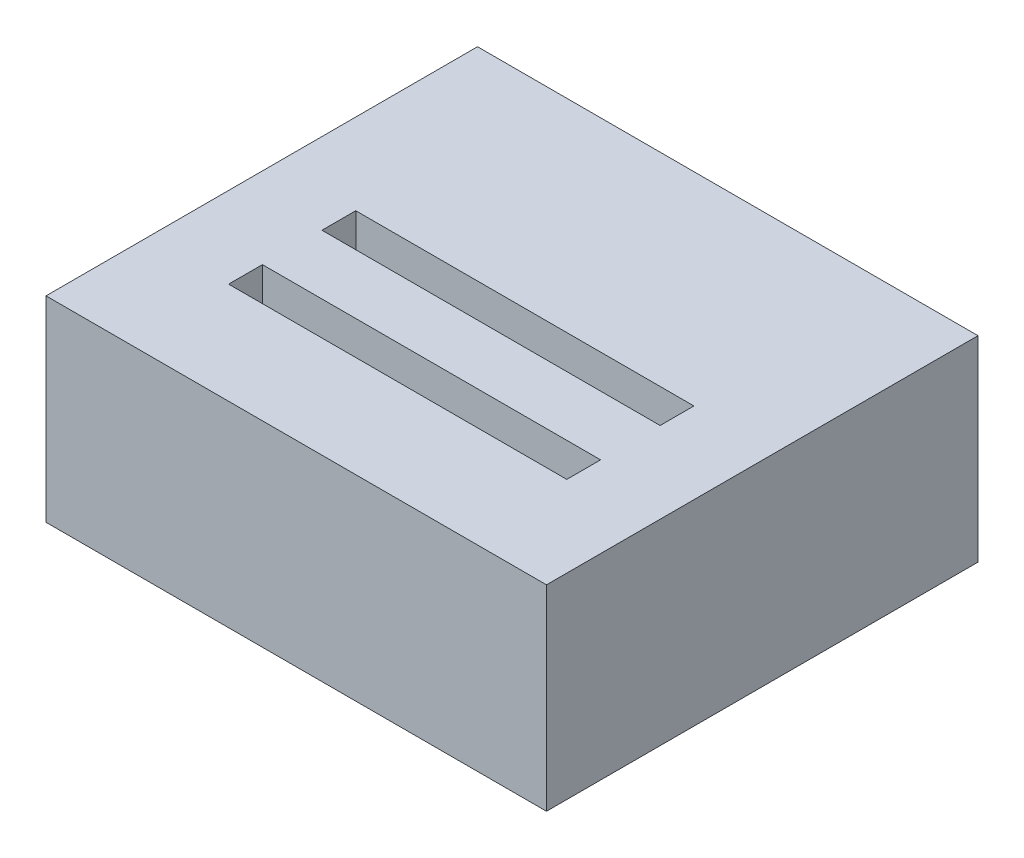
ISO-10303-21;
HEADER;
FILE_DESCRIPTION(('STEP AP214'),'2;1');
FILE_NAME('part.step','',(''),(''),'','','');
FILE_SCHEMA(('AUTOMOTIVE_DESIGN { 1 0 10303 214 1 1 1 1 }'));
ENDSEC;
DATA;
#1=APPLICATION_CONTEXT('core data for automotive mechanical design processes');
#2=APPLICATION_PROTOCOL_DEFINITION('international standard','automotive_design',2000,#1);
#3=PRODUCT_CONTEXT('',#1,'mechanical');
#4=PRODUCT('Part','Part','',(#3));
#5=PRODUCT_RELATED_PRODUCT_CATEGORY('part','',(#4));
#6=PRODUCT_DEFINITION_FORMATION('','',#4);
#7=PRODUCT_DEFINITION_CONTEXT('part definition',#1,'design');
#8=PRODUCT_DEFINITION('design','',#6,#7);
#9=PRODUCT_DEFINITION_SHAPE('','',#8);
#10=(LENGTH_UNIT() NAMED_UNIT(*) SI_UNIT(.MILLI.,.METRE.));
#11=(NAMED_UNIT(*) PLANE_ANGLE_UNIT() SI_UNIT($,.RADIAN.));
#12=(NAMED_UNIT(*) SI_UNIT($,.STERADIAN.) SOLID_ANGLE_UNIT());
#13=UNCERTAINTY_MEASURE_WITH_UNIT(LENGTH_MEASURE(1.E-05),#10,'distance_accuracy_value','');
#14=(GEOMETRIC_REPRESENTATION_CONTEXT(3) GLOBAL_UNCERTAINTY_ASSIGNED_CONTEXT((#13)) GLOBAL_UNIT_ASSIGNED_CONTEXT((#10,
#11,#12)) REPRESENTATION_CONTEXT('',''));
#15=CARTESIAN_POINT('',(0.,0.,0.));
#16=DIRECTION('',(0.,0.,1.));
#17=DIRECTION('',(1.,0.,0.));
#18=AXIS2_PLACEMENT_3D('',#15,#16,#17);
#19=CARTESIAN_POINT('',(-4.318,-2.413,7.62));
#20=DIRECTION('',(0.,1.,0.));
#21=DIRECTION('',(0.,0.,1.));
#22=AXIS2_PLACEMENT_3D('',#19,#20,#21);
#23=PLANE('',#22);
#24=DIRECTION('',(0.,0.,-1.));
#25=VECTOR('',#24,1.);
#26=CARTESIAN_POINT('',(-1.27,-2.413,12.3952));
#27=LINE('',#26,#25);
#28=CARTESIAN_POINT('',(-1.27,-2.413,12.3952));
#29=VERTEX_POINT('',#28);
#30=CARTESIAN_POINT('',(-1.27,-2.413,11.1252));
#31=VERTEX_POINT('',#30);
#32=EDGE_CURVE('E301',#29,#31,#27,.T.);
#33=ORIENTED_EDGE('',*,*,#32,.F.);
#34=DIRECTION('',(1.,0.,0.));
#35=VECTOR('',#34,1.);
#36=CARTESIAN_POINT('',(-4.318,-2.413,12.3952));
#37=LINE('',#36,#35);
#38=CARTESIAN_POINT('',(11.43,-2.413,12.3952));
#39=VERTEX_POINT('',#38);
#40=EDGE_CURVE('E169',#29,#39,#37,.T.);
#41=ORIENTED_EDGE('',*,*,#40,.T.);
#42=DIRECTION('',(0.,0.,-1.));
#43=VECTOR('',#42,1.);
#44=CARTESIAN_POINT('',(11.43,-2.413,12.3952));
#45=LINE('',#44,#43);
#46=CARTESIAN_POINT('',(11.43,-2.413,11.1252));
#47=VERTEX_POINT('',#46);
#48=EDGE_CURVE('E277',#39,#47,#45,.T.);
#49=ORIENTED_EDGE('',*,*,#48,.T.);
#50=DIRECTION('',(1.,0.,0.));
#51=VECTOR('',#50,1.);
#52=CARTESIAN_POINT('',(-4.318,-2.413,11.1252));
#53=LINE('',#52,#51);
#54=EDGE_CURVE('E299',#31,#47,#53,.T.);
#55=ORIENTED_EDGE('',*,*,#54,.F.);
#56=EDGE_LOOP('',(#33,#41,#49,#55));
#57=FACE_BOUND('',#56,.T.);
#58=DIRECTION('',(0.,0.,-1.));
#59=VECTOR('',#58,1.);
#60=CARTESIAN_POINT('',(2.667,-2.413,0.));
#61=LINE('',#60,#59);
#62=CARTESIAN_POINT('',(2.667,-2.413,7.62));
#63=VERTEX_POINT('',#62);
#64=CARTESIAN_POINT('',(2.667,-2.413,0.));
#65=VERTEX_POINT('',#64);
#66=EDGE_CURVE('E168',#63,#65,#61,.T.);
#67=ORIENTED_EDGE('',*,*,#66,.F.);
#68=DIRECTION('',(1.,0.,0.));
#69=VECTOR('',#68,1.);
#70=CARTESIAN_POINT('',(-4.318,-2.413,7.62));
#71=LINE('',#70,#69);
#72=CARTESIAN_POINT('',(-1.27,-2.413,7.62));
#73=VERTEX_POINT('',#72);
#74=EDGE_CURVE('E207',#73,#63,#71,.T.);
#75=ORIENTED_EDGE('',*,*,#74,.F.);
#76=DIRECTION('',(0.,0.,-1.));
#77=VECTOR('',#76,1.);
#78=CARTESIAN_POINT('',(-1.27,-2.413,8.89));
#79=LINE('',#78,#77);
#80=CARTESIAN_POINT('',(-1.27,-2.413,8.89));
#81=VERTEX_POINT('',#80);
#82=EDGE_CURVE('E338',#81,#73,#79,.T.);
#83=ORIENTED_EDGE('',*,*,#82,.F.);
#84=DIRECTION('',(1.,0.,0.));
#85=VECTOR('',#84,1.);
#86=CARTESIAN_POINT('',(-4.318,-2.413,8.89));
#87=LINE('',#86,#85);
#88=CARTESIAN_POINT('',(11.43,-2.413,8.89));
#89=VERTEX_POINT('',#88);
#90=EDGE_CURVE('E305',#81,#89,#87,.T.);
#91=ORIENTED_EDGE('',*,*,#90,.T.);
#92=DIRECTION('',(0.,0.,-1.));
#93=VECTOR('',#92,1.);
#94=CARTESIAN_POINT('',(11.43,-2.413,8.89));
#95=LINE('',#94,#93);
#96=CARTESIAN_POINT('',(11.43,-2.413,7.62));
#97=VERTEX_POINT('',#96);
#98=EDGE_CURVE('E321',#89,#97,#95,.T.);
#99=ORIENTED_EDGE('',*,*,#98,.T.);
#100=CARTESIAN_POINT('',(7.493,-2.413,7.62));
#101=VERTEX_POINT('',#100);
#102=EDGE_CURVE('E212',#101,#97,#71,.T.);
#103=ORIENTED_EDGE('',*,*,#102,.F.);
#104=DIRECTION('',(0.,0.,1.));
#105=VECTOR('',#104,1.);
#106=CARTESIAN_POINT('',(7.493,-2.413,0.));
#107=LINE('',#106,#105);
#108=CARTESIAN_POINT('',(7.493,-2.413,0.));
#109=VERTEX_POINT('',#108);
#110=EDGE_CURVE('E50',#109,#101,#107,.T.);
#111=ORIENTED_EDGE('',*,*,#110,.F.);
#112=DIRECTION('',(1.,0.,0.));
#113=VECTOR('',#112,1.);
#114=CARTESIAN_POINT('',(-4.318,-2.413,0.));
#115=LINE('',#114,#113);
#116=CARTESIAN_POINT('',(14.478,-2.413,0.));
#117=VERTEX_POINT('',#116);
#118=EDGE_CURVE('E194',#109,#117,#115,.T.);
#119=ORIENTED_EDGE('',*,*,#118,.T.);
#120=DIRECTION('',(0.,0.,-1.));
#121=VECTOR('',#120,1.);
#122=CARTESIAN_POINT('',(14.478,-2.413,7.62));
#123=LINE('',#122,#121);
#124=CARTESIAN_POINT('',(14.478,-2.413,16.2052));
#125=VERTEX_POINT('',#124);
#126=EDGE_CURVE('E42',#125,#117,#123,.T.);
#127=ORIENTED_EDGE('',*,*,#126,.F.);
#128=DIRECTION('',(1.,0.,0.));
#129=VECTOR('',#128,1.);
#130=CARTESIAN_POINT('',(-4.318,-2.413,16.2052));
#131=LINE('',#130,#129);
#132=CARTESIAN_POINT('',(-4.318,-2.413,16.2052));
#133=VERTEX_POINT('',#132);
#134=EDGE_CURVE('E266',#133,#125,#131,.T.);
#135=ORIENTED_EDGE('',*,*,#134,.F.);
#136=DIRECTION('',(0.,0.,-1.));
#137=VECTOR('',#136,1.);
#138=CARTESIAN_POINT('',(-4.318,-2.413,7.62));
#139=LINE('',#138,#137);
#140=CARTESIAN_POINT('',(-4.318,-2.413,0.));
#141=VERTEX_POINT('',#140);
#142=EDGE_CURVE('E11',#133,#141,#139,.T.);
#143=ORIENTED_EDGE('',*,*,#142,.T.);
#144=EDGE_CURVE('E56',#141,#65,#115,.T.);
#145=ORIENTED_EDGE('',*,*,#144,.T.);
#146=EDGE_LOOP('',(#67,#75,#83,#91,#99,#103,#111,#119,#127,#135,#143,#145));
#147=FACE_BOUND('',#146,.T.);
#148=ADVANCED_FACE('F33',(#57,#147),#23,.F.);
#149=CARTESIAN_POINT('',(-4.318,-2.413,11.1252));
#150=DIRECTION('',(0.,0.,1.));
#151=DIRECTION('',(1.,0.,0.));
#152=AXIS2_PLACEMENT_3D('',#149,#150,#151);
#153=PLANE('',#152);
#154=ORIENTED_EDGE('',*,*,#54,.T.);
#155=DIRECTION('',(0.,-1.,0.));
#156=VECTOR('',#155,1.);
#157=CARTESIAN_POINT('',(11.43,4.953,11.1252));
#158=LINE('',#157,#156);
#159=CARTESIAN_POINT('',(11.43,4.953,11.1252));
#160=VERTEX_POINT('',#159);
#161=EDGE_CURVE('E278',#160,#47,#158,.T.);
#162=ORIENTED_EDGE('',*,*,#161,.F.);
#163=DIRECTION('',(-1.,0.,0.));
#164=VECTOR('',#163,1.);
#165=CARTESIAN_POINT('',(-4.318,4.953,11.1252));
#166=LINE('',#165,#164);
#167=CARTESIAN_POINT('',(-1.27,4.953,11.1252));
#168=VERTEX_POINT('',#167);
#169=EDGE_CURVE('E232',#160,#168,#166,.T.);
#170=ORIENTED_EDGE('',*,*,#169,.T.);
#171=DIRECTION('',(0.,1.,0.));
#172=VECTOR('',#171,1.);
#173=CARTESIAN_POINT('',(-1.27,4.953,11.1252));
#174=LINE('',#173,#172);
#175=EDGE_CURVE('E287',#31,#168,#174,.T.);
#176=ORIENTED_EDGE('',*,*,#175,.F.);
#177=EDGE_LOOP('',(#154,#162,#170,#176));
#178=FACE_BOUND('',#177,.T.);
#179=ADVANCED_FACE('F396',(#178),#153,.T.);
#180=CARTESIAN_POINT('',(-4.318,-2.413,7.62));
#181=DIRECTION('',(0.,0.,1.));
#182=DIRECTION('',(1.,0.,0.));
#183=AXIS2_PLACEMENT_3D('',#180,#181,#182);
#184=PLANE('',#183);
#185=CARTESIAN_POINT('',(0.,0.,7.62));
#186=DIRECTION('',(0.,0.,1.));
#187=DIRECTION('',(1.,0.,0.));
#188=AXIS2_PLACEMENT_3D('',#185,#186,#187);
#189=CIRCLE('',#188,0.508);
#190=CARTESIAN_POINT('',(0.508,0.,7.62));
#191=VERTEX_POINT('',#190);
#192=EDGE_CURVE('E226',#191,#191,#189,.F.);
#193=ORIENTED_EDGE('',*,*,#192,.T.);
#194=EDGE_LOOP('',(#193));
#195=FACE_BOUND('',#194,.T.);
#196=CARTESIAN_POINT('',(2.54,0.,7.62));
#197=DIRECTION('',(0.,0.,1.));
#198=DIRECTION('',(1.,0.,0.));
#199=AXIS2_PLACEMENT_3D('',#196,#197,#198);
#200=CIRCLE('',#199,0.508);
#201=CARTESIAN_POINT('',(3.048,0.,7.62));
#202=VERTEX_POINT('',#201);
#203=EDGE_CURVE('E386',#202,#202,#200,.F.);
#204=ORIENTED_EDGE('',*,*,#203,.T.);
#205=EDGE_LOOP('',(#204));
#206=FACE_BOUND('',#205,.T.);
#207=CARTESIAN_POINT('',(5.08,0.,7.62));
#208=DIRECTION('',(0.,0.,1.));
#209=DIRECTION('',(1.,0.,0.));
#210=AXIS2_PLACEMENT_3D('',#207,#208,#209);
#211=CIRCLE('',#210,0.508);
#212=CARTESIAN_POINT('',(5.588,0.,7.62));
#213=VERTEX_POINT('',#212);
#214=EDGE_CURVE('E380',#213,#213,#211,.F.);
#215=ORIENTED_EDGE('',*,*,#214,.T.);
#216=EDGE_LOOP('',(#215));
#217=FACE_BOUND('',#216,.T.);
#218=CARTESIAN_POINT('',(7.62,0.,7.62));
#219=DIRECTION('',(0.,0.,1.));
#220=DIRECTION('',(1.,0.,0.));
#221=AXIS2_PLACEMENT_3D('',#218,#219,#220);
#222=CIRCLE('',#221,0.508);
#223=CARTESIAN_POINT('',(8.128,0.,7.62));
#224=VERTEX_POINT('',#223);
#225=EDGE_CURVE('E374',#224,#224,#222,.F.);
#226=ORIENTED_EDGE('',*,*,#225,.T.);
#227=EDGE_LOOP('',(#226));
#228=FACE_BOUND('',#227,.T.);
#229=CARTESIAN_POINT('',(10.16,0.,7.62));
#230=DIRECTION('',(0.,0.,1.));
#231=DIRECTION('',(1.,0.,0.));
#232=AXIS2_PLACEMENT_3D('',#229,#230,#231);
#233=CIRCLE('',#232,0.508);
#234=CARTESIAN_POINT('',(10.668,0.,7.62));
#235=VERTEX_POINT('',#234);
#236=EDGE_CURVE('E368',#235,#235,#233,.F.);
#237=ORIENTED_EDGE('',*,*,#236,.T.);
#238=EDGE_LOOP('',(#237));
#239=FACE_BOUND('',#238,.T.);
#240=CARTESIAN_POINT('',(0.,2.54,7.62));
#241=DIRECTION('',(0.,0.,1.));
#242=DIRECTION('',(1.,0.,0.));
#243=AXIS2_PLACEMENT_3D('',#240,#241,#242);
#244=CIRCLE('',#243,0.508);
#245=CARTESIAN_POINT('',(0.508,2.54,7.62));
#246=VERTEX_POINT('',#245);
#247=EDGE_CURVE('E362',#246,#246,#244,.F.);
#248=ORIENTED_EDGE('',*,*,#247,.T.);
#249=EDGE_LOOP('',(#248));
#250=FACE_BOUND('',#249,.T.);
#251=CARTESIAN_POINT('',(2.54,2.54,7.62));
#252=DIRECTION('',(0.,0.,1.));
#253=DIRECTION('',(1.,0.,0.));
#254=AXIS2_PLACEMENT_3D('',#251,#252,#253);
#255=CIRCLE('',#254,0.508);
#256=CARTESIAN_POINT('',(3.048,2.54,7.62));
#257=VERTEX_POINT('',#256);
#258=EDGE_CURVE('E356',#257,#257,#255,.F.);
#259=ORIENTED_EDGE('',*,*,#258,.T.);
#260=EDGE_LOOP('',(#259));
#261=FACE_BOUND('',#260,.T.);
#262=CARTESIAN_POINT('',(5.08,2.54,7.62));
#263=DIRECTION('',(0.,0.,1.));
#264=DIRECTION('',(1.,0.,0.));
#265=AXIS2_PLACEMENT_3D('',#262,#263,#264);
#266=CIRCLE('',#265,0.508);
#267=CARTESIAN_POINT('',(5.588,2.54,7.62));
#268=VERTEX_POINT('',#267);
#269=EDGE_CURVE('E350',#268,#268,#266,.F.);
#270=ORIENTED_EDGE('',*,*,#269,.T.);
#271=EDGE_LOOP('',(#270));
#272=FACE_BOUND('',#271,.T.);
#273=CARTESIAN_POINT('',(7.62,2.54,7.62));
#274=DIRECTION('',(0.,0.,1.));
#275=DIRECTION('',(1.,0.,0.));
#276=AXIS2_PLACEMENT_3D('',#273,#274,#275);
#277=CIRCLE('',#276,0.508);
#278=CARTESIAN_POINT('',(8.128,2.54,7.62));
#279=VERTEX_POINT('',#278);
#280=EDGE_CURVE('E344',#279,#279,#277,.F.);
#281=ORIENTED_EDGE('',*,*,#280,.T.);
#282=EDGE_LOOP('',(#281));
#283=FACE_BOUND('',#282,.T.);
#284=CARTESIAN_POINT('',(10.16,2.54,7.62));
#285=DIRECTION('',(0.,0.,1.));
#286=DIRECTION('',(1.,0.,0.));
#287=AXIS2_PLACEMENT_3D('',#284,#285,#286);
#288=CIRCLE('',#287,0.508);
#289=CARTESIAN_POINT('',(10.668,2.54,7.62));
#290=VERTEX_POINT('',#289);
#291=EDGE_CURVE('E337',#290,#290,#288,.F.);
#292=ORIENTED_EDGE('',*,*,#291,.T.);
#293=EDGE_LOOP('',(#292));
#294=FACE_BOUND('',#293,.T.);
#295=ORIENTED_EDGE('',*,*,#74,.T.);
#296=DIRECTION('',(0.,1.,0.));
#297=VECTOR('',#296,1.);
#298=CARTESIAN_POINT('',(2.667,-3.048,7.62));
#299=LINE('',#298,#297);
#300=CARTESIAN_POINT('',(2.667,-3.048,7.62));
#301=VERTEX_POINT('',#300);
#302=EDGE_CURVE('E182',#301,#63,#299,.T.);
#303=ORIENTED_EDGE('',*,*,#302,.F.);
#304=DIRECTION('',(-1.,0.,0.));
#305=VECTOR('',#304,1.);
#306=CARTESIAN_POINT('',(2.667,-3.048,7.62));
#307=LINE('',#306,#305);
#308=CARTESIAN_POINT('',(7.493,-3.048,7.62));
#309=VERTEX_POINT('',#308);
#310=EDGE_CURVE('E162',#309,#301,#307,.T.);
#311=ORIENTED_EDGE('',*,*,#310,.F.);
#312=DIRECTION('',(0.,1.,0.));
#313=VECTOR('',#312,1.);
#314=CARTESIAN_POINT('',(7.493,-3.048,7.62));
#315=LINE('',#314,#313);
#316=EDGE_CURVE('E174',#309,#101,#315,.T.);
#317=ORIENTED_EDGE('',*,*,#316,.T.);
#318=ORIENTED_EDGE('',*,*,#102,.T.);
#319=DIRECTION('',(0.,-1.,0.));
#320=VECTOR('',#319,1.);
#321=CARTESIAN_POINT('',(11.43,4.953,7.62));
#322=LINE('',#321,#320);
#323=CARTESIAN_POINT('',(11.43,4.953,7.62));
#324=VERTEX_POINT('',#323);
#325=EDGE_CURVE('E322',#324,#97,#322,.T.);
#326=ORIENTED_EDGE('',*,*,#325,.F.);
#327=DIRECTION('',(-1.,0.,0.));
#328=VECTOR('',#327,1.);
#329=CARTESIAN_POINT('',(-4.318,4.953,7.62));
#330=LINE('',#329,#328);
#331=CARTESIAN_POINT('',(-1.27,4.953,7.62));
#332=VERTEX_POINT('',#331);
#333=EDGE_CURVE('E211',#324,#332,#330,.T.);
#334=ORIENTED_EDGE('',*,*,#333,.T.);
#335=DIRECTION('',(0.,1.,0.));
#336=VECTOR('',#335,1.);
#337=CARTESIAN_POINT('',(-1.27,4.953,7.62));
#338=LINE('',#337,#336);
#339=EDGE_CURVE('E209',#73,#332,#338,.T.);
#340=ORIENTED_EDGE('',*,*,#339,.F.);
#341=EDGE_LOOP('',(#295,#303,#311,#317,#318,#326,#334,#340));
#342=FACE_BOUND('',#341,.T.);
#343=ADVANCED_FACE('F205',(#195,#206,#217,#228,#239,#250,#261,#272,#283,#294,#342),#184,.T.);
#344=CARTESIAN_POINT('',(-4.318,4.953,7.62));
#345=DIRECTION('',(1.,0.,0.));
#346=DIRECTION('',(0.,1.,0.));
#347=AXIS2_PLACEMENT_3D('',#344,#345,#346);
#348=PLANE('',#347);
#349=DIRECTION('',(0.,-1.,0.));
#350=VECTOR('',#349,1.);
#351=CARTESIAN_POINT('',(-4.318,4.953,0.));
#352=LINE('',#351,#350);
#353=CARTESIAN_POINT('',(-4.318,4.953,0.));
#354=VERTEX_POINT('',#353);
#355=EDGE_CURVE('E238',#354,#141,#352,.T.);
#356=ORIENTED_EDGE('',*,*,#355,.T.);
#357=ORIENTED_EDGE('',*,*,#142,.F.);
#358=DIRECTION('',(0.,-1.,0.));
#359=VECTOR('',#358,1.);
#360=CARTESIAN_POINT('',(-4.318,4.953,16.2052));
#361=LINE('',#360,#359);
#362=CARTESIAN_POINT('',(-4.318,4.953,16.2052));
#363=VERTEX_POINT('',#362);
#364=EDGE_CURVE('E189',#363,#133,#361,.T.);
#365=ORIENTED_EDGE('',*,*,#364,.F.);
#366=DIRECTION('',(0.,0.,-1.));
#367=VECTOR('',#366,1.);
#368=CARTESIAN_POINT('',(-4.318,4.953,7.62));
#369=LINE('',#368,#367);
#370=EDGE_CURVE('E214',#363,#354,#369,.T.);
#371=ORIENTED_EDGE('',*,*,#370,.T.);
#372=EDGE_LOOP('',(#356,#357,#365,#371));
#373=FACE_BOUND('',#372,.T.);
#374=ADVANCED_FACE('F35',(#373),#348,.F.);
#375=CARTESIAN_POINT('',(14.478,4.953,7.62));
#376=DIRECTION('',(-1.,0.,0.));
#377=DIRECTION('',(0.,0.,1.));
#378=AXIS2_PLACEMENT_3D('',#375,#376,#377);
#379=PLANE('',#378);
#380=DIRECTION('',(0.,1.,0.));
#381=VECTOR('',#380,1.);
#382=CARTESIAN_POINT('',(14.478,4.953,0.));
#383=LINE('',#382,#381);
#384=CARTESIAN_POINT('',(14.478,4.953,0.));
#385=VERTEX_POINT('',#384);
#386=EDGE_CURVE('E235',#117,#385,#383,.T.);
#387=ORIENTED_EDGE('',*,*,#386,.T.);
#388=DIRECTION('',(0.,0.,-1.));
#389=VECTOR('',#388,1.);
#390=CARTESIAN_POINT('',(14.478,4.953,7.62));
#391=LINE('',#390,#389);
#392=CARTESIAN_POINT('',(14.478,4.953,16.2052));
#393=VERTEX_POINT('',#392);
#394=EDGE_CURVE('E244',#393,#385,#391,.T.);
#395=ORIENTED_EDGE('',*,*,#394,.F.);
#396=DIRECTION('',(0.,1.,0.));
#397=VECTOR('',#396,1.);
#398=CARTESIAN_POINT('',(14.478,4.953,16.2052));
#399=LINE('',#398,#397);
#400=EDGE_CURVE('E252',#125,#393,#399,.T.);
#401=ORIENTED_EDGE('',*,*,#400,.F.);
#402=ORIENTED_EDGE('',*,*,#126,.T.);
#403=EDGE_LOOP('',(#387,#395,#401,#402));
#404=FACE_BOUND('',#403,.T.);
#405=ADVANCED_FACE('F250',(#404),#379,.F.);
#406=CARTESIAN_POINT('',(-4.318,4.953,7.62));
#407=DIRECTION('',(0.,-1.,0.));
#408=DIRECTION('',(0.,0.,-1.));
#409=AXIS2_PLACEMENT_3D('',#406,#407,#408);
#410=PLANE('',#409);
#411=ORIENTED_EDGE('',*,*,#370,.F.);
#412=DIRECTION('',(-1.,0.,0.));
#413=VECTOR('',#412,1.);
#414=CARTESIAN_POINT('',(-4.318,4.953,16.2052));
#415=LINE('',#414,#413);
#416=EDGE_CURVE('E281',#393,#363,#415,.T.);
#417=ORIENTED_EDGE('',*,*,#416,.F.);
#418=ORIENTED_EDGE('',*,*,#394,.T.);
#419=DIRECTION('',(-1.,0.,0.));
#420=VECTOR('',#419,1.);
#421=CARTESIAN_POINT('',(-4.318,4.953,0.));
#422=LINE('',#421,#420);
#423=EDGE_CURVE('E216',#385,#354,#422,.T.);
#424=ORIENTED_EDGE('',*,*,#423,.T.);
#425=EDGE_LOOP('',(#411,#417,#418,#424));
#426=FACE_BOUND('',#425,.T.);
#427=DIRECTION('',(-1.,0.,0.));
#428=VECTOR('',#427,1.);
#429=CARTESIAN_POINT('',(-4.318,4.953,12.3952));
#430=LINE('',#429,#428);
#431=CARTESIAN_POINT('',(11.43,4.953,12.3952));
#432=VERTEX_POINT('',#431);
#433=CARTESIAN_POINT('',(-1.27,4.953,12.3952));
#434=VERTEX_POINT('',#433);
#435=EDGE_CURVE('E172',#432,#434,#430,.T.);
#436=ORIENTED_EDGE('',*,*,#435,.T.);
#437=DIRECTION('',(0.,0.,-1.));
#438=VECTOR('',#437,1.);
#439=CARTESIAN_POINT('',(-1.27,4.953,12.3952));
#440=LINE('',#439,#438);
#441=EDGE_CURVE('E291',#434,#168,#440,.T.);
#442=ORIENTED_EDGE('',*,*,#441,.T.);
#443=ORIENTED_EDGE('',*,*,#169,.F.);
#444=DIRECTION('',(0.,0.,-1.));
#445=VECTOR('',#444,1.);
#446=CARTESIAN_POINT('',(11.43,4.953,12.3952));
#447=LINE('',#446,#445);
#448=EDGE_CURVE('E284',#432,#160,#447,.T.);
#449=ORIENTED_EDGE('',*,*,#448,.F.);
#450=EDGE_LOOP('',(#436,#442,#443,#449));
#451=FACE_BOUND('',#450,.T.);
#452=DIRECTION('',(-1.,0.,0.));
#453=VECTOR('',#452,1.);
#454=CARTESIAN_POINT('',(-4.318,4.953,8.89));
#455=LINE('',#454,#453);
#456=CARTESIAN_POINT('',(11.43,4.953,8.89));
#457=VERTEX_POINT('',#456);
#458=CARTESIAN_POINT('',(-1.27,4.953,8.89));
#459=VERTEX_POINT('',#458);
#460=EDGE_CURVE('E310',#457,#459,#455,.T.);
#461=ORIENTED_EDGE('',*,*,#460,.T.);
#462=DIRECTION('',(0.,0.,-1.));
#463=VECTOR('',#462,1.);
#464=CARTESIAN_POINT('',(-1.27,4.953,8.89));
#465=LINE('',#464,#463);
#466=EDGE_CURVE('E331',#459,#332,#465,.T.);
#467=ORIENTED_EDGE('',*,*,#466,.T.);
#468=ORIENTED_EDGE('',*,*,#333,.F.);
#469=DIRECTION('',(0.,0.,-1.));
#470=VECTOR('',#469,1.);
#471=CARTESIAN_POINT('',(11.43,4.953,8.89));
#472=LINE('',#471,#470);
#473=EDGE_CURVE('E326',#457,#324,#472,.T.);
#474=ORIENTED_EDGE('',*,*,#473,.F.);
#475=EDGE_LOOP('',(#461,#467,#468,#474));
#476=FACE_BOUND('',#475,.T.);
#477=ADVANCED_FACE('F258',(#426,#451,#476),#410,.F.);
#478=CARTESIAN_POINT('',(-4.318,-2.413,0.));
#479=DIRECTION('',(0.,0.,1.));
#480=DIRECTION('',(1.,0.,0.));
#481=AXIS2_PLACEMENT_3D('',#478,#479,#480);
#482=PLANE('',#481);
#483=CARTESIAN_POINT('',(10.16,2.54,0.));
#484=DIRECTION('',(0.,0.,-1.));
#485=DIRECTION('',(-1.,0.,0.));
#486=AXIS2_PLACEMENT_3D('',#483,#484,#485);
#487=CIRCLE('',#486,0.508);
#488=CARTESIAN_POINT('',(9.652,2.54,0.));
#489=VERTEX_POINT('',#488);
#490=EDGE_CURVE('E334',#489,#489,#487,.T.);
#491=ORIENTED_EDGE('',*,*,#490,.F.);
#492=EDGE_LOOP('',(#491));
#493=FACE_BOUND('',#492,.T.);
#494=CARTESIAN_POINT('',(7.62,2.54,0.));
#495=DIRECTION('',(0.,0.,-1.));
#496=DIRECTION('',(-1.,0.,0.));
#497=AXIS2_PLACEMENT_3D('',#494,#495,#496);
#498=CIRCLE('',#497,0.508);
#499=CARTESIAN_POINT('',(7.112,2.54,0.));
#500=VERTEX_POINT('',#499);
#501=EDGE_CURVE('E341',#500,#500,#498,.T.);
#502=ORIENTED_EDGE('',*,*,#501,.F.);
#503=EDGE_LOOP('',(#502));
#504=FACE_BOUND('',#503,.T.);
#505=CARTESIAN_POINT('',(5.08,2.54,0.));
#506=DIRECTION('',(0.,0.,-1.));
#507=DIRECTION('',(-1.,0.,0.));
#508=AXIS2_PLACEMENT_3D('',#505,#506,#507);
#509=CIRCLE('',#508,0.508);
#510=CARTESIAN_POINT('',(4.572,2.54,0.));
#511=VERTEX_POINT('',#510);
#512=EDGE_CURVE('E347',#511,#511,#509,.T.);
#513=ORIENTED_EDGE('',*,*,#512,.F.);
#514=EDGE_LOOP('',(#513));
#515=FACE_BOUND('',#514,.T.);
#516=CARTESIAN_POINT('',(2.54,2.54,0.));
#517=DIRECTION('',(0.,0.,-1.));
#518=DIRECTION('',(-1.,0.,0.));
#519=AXIS2_PLACEMENT_3D('',#516,#517,#518);
#520=CIRCLE('',#519,0.508);
#521=CARTESIAN_POINT('',(2.032,2.54,0.));
#522=VERTEX_POINT('',#521);
#523=EDGE_CURVE('E353',#522,#522,#520,.T.);
#524=ORIENTED_EDGE('',*,*,#523,.F.);
#525=EDGE_LOOP('',(#524));
#526=FACE_BOUND('',#525,.T.);
#527=CARTESIAN_POINT('',(0.,2.54,0.));
#528=DIRECTION('',(0.,0.,-1.));
#529=DIRECTION('',(-1.,0.,0.));
#530=AXIS2_PLACEMENT_3D('',#527,#528,#529);
#531=CIRCLE('',#530,0.508);
#532=CARTESIAN_POINT('',(-0.508,2.54,0.));
#533=VERTEX_POINT('',#532);
#534=EDGE_CURVE('E359',#533,#533,#531,.T.);
#535=ORIENTED_EDGE('',*,*,#534,.F.);
#536=EDGE_LOOP('',(#535));
#537=FACE_BOUND('',#536,.T.);
#538=CARTESIAN_POINT('',(10.16,0.,0.));
#539=DIRECTION('',(0.,0.,-1.));
#540=DIRECTION('',(-1.,0.,0.));
#541=AXIS2_PLACEMENT_3D('',#538,#539,#540);
#542=CIRCLE('',#541,0.508);
#543=CARTESIAN_POINT('',(9.652,0.,0.));
#544=VERTEX_POINT('',#543);
#545=EDGE_CURVE('E365',#544,#544,#542,.T.);
#546=ORIENTED_EDGE('',*,*,#545,.F.);
#547=EDGE_LOOP('',(#546));
#548=FACE_BOUND('',#547,.T.);
#549=CARTESIAN_POINT('',(7.62,0.,0.));
#550=DIRECTION('',(0.,0.,-1.));
#551=DIRECTION('',(-1.,0.,0.));
#552=AXIS2_PLACEMENT_3D('',#549,#550,#551);
#553=CIRCLE('',#552,0.508);
#554=CARTESIAN_POINT('',(7.112,0.,0.));
#555=VERTEX_POINT('',#554);
#556=EDGE_CURVE('E371',#555,#555,#553,.T.);
#557=ORIENTED_EDGE('',*,*,#556,.F.);
#558=EDGE_LOOP('',(#557));
#559=FACE_BOUND('',#558,.T.);
#560=CARTESIAN_POINT('',(5.08,0.,0.));
#561=DIRECTION('',(0.,0.,-1.));
#562=DIRECTION('',(-1.,0.,0.));
#563=AXIS2_PLACEMENT_3D('',#560,#561,#562);
#564=CIRCLE('',#563,0.508);
#565=CARTESIAN_POINT('',(4.572,0.,0.));
#566=VERTEX_POINT('',#565);
#567=EDGE_CURVE('E377',#566,#566,#564,.T.);
#568=ORIENTED_EDGE('',*,*,#567,.F.);
#569=EDGE_LOOP('',(#568));
#570=FACE_BOUND('',#569,.T.);
#571=CARTESIAN_POINT('',(2.54,0.,0.));
#572=DIRECTION('',(0.,0.,-1.));
#573=DIRECTION('',(-1.,0.,0.));
#574=AXIS2_PLACEMENT_3D('',#571,#572,#573);
#575=CIRCLE('',#574,0.508);
#576=CARTESIAN_POINT('',(2.032,0.,0.));
#577=VERTEX_POINT('',#576);
#578=EDGE_CURVE('E383',#577,#577,#575,.T.);
#579=ORIENTED_EDGE('',*,*,#578,.F.);
#580=EDGE_LOOP('',(#579));
#581=FACE_BOUND('',#580,.T.);
#582=CARTESIAN_POINT('',(0.,0.,0.));
#583=DIRECTION('',(0.,0.,-1.));
#584=DIRECTION('',(-1.,0.,0.));
#585=AXIS2_PLACEMENT_3D('',#582,#583,#584);
#586=CIRCLE('',#585,0.508);
#587=CARTESIAN_POINT('',(-0.508,0.,0.));
#588=VERTEX_POINT('',#587);
#589=EDGE_CURVE('E388',#588,#588,#586,.T.);
#590=ORIENTED_EDGE('',*,*,#589,.F.);
#591=EDGE_LOOP('',(#590));
#592=FACE_BOUND('',#591,.T.);
#593=ORIENTED_EDGE('',*,*,#355,.F.);
#594=ORIENTED_EDGE('',*,*,#423,.F.);
#595=ORIENTED_EDGE('',*,*,#386,.F.);
#596=ORIENTED_EDGE('',*,*,#118,.F.);
#597=DIRECTION('',(0.,1.,0.));
#598=VECTOR('',#597,1.);
#599=CARTESIAN_POINT('',(7.493,-3.048,0.));
#600=LINE('',#599,#598);
#601=CARTESIAN_POINT('',(7.493,-3.048,0.));
#602=VERTEX_POINT('',#601);
#603=EDGE_CURVE('E153',#602,#109,#600,.T.);
#604=ORIENTED_EDGE('',*,*,#603,.F.);
#605=DIRECTION('',(1.,0.,0.));
#606=VECTOR('',#605,1.);
#607=CARTESIAN_POINT('',(2.667,-3.048,0.));
#608=LINE('',#607,#606);
#609=CARTESIAN_POINT('',(2.667,-3.048,0.));
#610=VERTEX_POINT('',#609);
#611=EDGE_CURVE('E145',#610,#602,#608,.T.);
#612=ORIENTED_EDGE('',*,*,#611,.F.);
#613=DIRECTION('',(0.,1.,0.));
#614=VECTOR('',#613,1.);
#615=CARTESIAN_POINT('',(2.667,-3.048,0.));
#616=LINE('',#615,#614);
#617=EDGE_CURVE('E150',#610,#65,#616,.T.);
#618=ORIENTED_EDGE('',*,*,#617,.T.);
#619=ORIENTED_EDGE('',*,*,#144,.F.);
#620=EDGE_LOOP('',(#593,#594,#595,#596,#604,#612,#618,#619));
#621=FACE_BOUND('',#620,.T.);
#622=ADVANCED_FACE('F148',(#493,#504,#515,#526,#537,#548,#559,#570,#581,#592,#621),#482,.F.);
#623=CARTESIAN_POINT('',(0.,0.,9.05684097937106));
#624=DIRECTION('',(0.,0.,-1.));
#625=DIRECTION('',(-1.,0.,0.));
#626=AXIS2_PLACEMENT_3D('',#623,#624,#625);
#627=CYLINDRICAL_SURFACE('',#626,0.508);
#628=ORIENTED_EDGE('',*,*,#589,.T.);
#629=EDGE_LOOP('',(#628));
#630=FACE_BOUND('',#629,.T.);
#631=ORIENTED_EDGE('',*,*,#192,.F.);
#632=EDGE_LOOP('',(#631));
#633=FACE_BOUND('',#632,.T.);
#634=ADVANCED_FACE('F410',(#630,#633),#627,.F.);
#635=CARTESIAN_POINT('',(2.54,0.,9.05684097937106));
#636=DIRECTION('',(0.,0.,-1.));
#637=DIRECTION('',(-1.,0.,0.));
#638=AXIS2_PLACEMENT_3D('',#635,#636,#637);
#639=CYLINDRICAL_SURFACE('',#638,0.508);
#640=ORIENTED_EDGE('',*,*,#578,.T.);
#641=EDGE_LOOP('',(#640));
#642=FACE_BOUND('',#641,.T.);
#643=ORIENTED_EDGE('',*,*,#203,.F.);
#644=EDGE_LOOP('',(#643));
#645=FACE_BOUND('',#644,.T.);
#646=ADVANCED_FACE('F416',(#642,#645),#639,.F.);
#647=CARTESIAN_POINT('',(5.08,0.,9.05684097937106));
#648=DIRECTION('',(0.,0.,-1.));
#649=DIRECTION('',(-1.,0.,0.));
#650=AXIS2_PLACEMENT_3D('',#647,#648,#649);
#651=CYLINDRICAL_SURFACE('',#650,0.508);
#652=ORIENTED_EDGE('',*,*,#567,.T.);
#653=EDGE_LOOP('',(#652));
#654=FACE_BOUND('',#653,.T.);
#655=ORIENTED_EDGE('',*,*,#214,.F.);
#656=EDGE_LOOP('',(#655));
#657=FACE_BOUND('',#656,.T.);
#658=ADVANCED_FACE('F419',(#654,#657),#651,.F.);
#659=CARTESIAN_POINT('',(7.62,0.,9.05684097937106));
#660=DIRECTION('',(0.,0.,-1.));
#661=DIRECTION('',(-1.,0.,0.));
#662=AXIS2_PLACEMENT_3D('',#659,#660,#661);
#663=CYLINDRICAL_SURFACE('',#662,0.508);
#664=ORIENTED_EDGE('',*,*,#556,.T.);
#665=EDGE_LOOP('',(#664));
#666=FACE_BOUND('',#665,.T.);
#667=ORIENTED_EDGE('',*,*,#225,.F.);
#668=EDGE_LOOP('',(#667));
#669=FACE_BOUND('',#668,.T.);
#670=ADVANCED_FACE('F423',(#666,#669),#663,.F.);
#671=CARTESIAN_POINT('',(10.16,0.,9.05684097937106));
#672=DIRECTION('',(0.,0.,-1.));
#673=DIRECTION('',(-1.,0.,0.));
#674=AXIS2_PLACEMENT_3D('',#671,#672,#673);
#675=CYLINDRICAL_SURFACE('',#674,0.508);
#676=ORIENTED_EDGE('',*,*,#545,.T.);
#677=EDGE_LOOP('',(#676));
#678=FACE_BOUND('',#677,.T.);
#679=ORIENTED_EDGE('',*,*,#236,.F.);
#680=EDGE_LOOP('',(#679));
#681=FACE_BOUND('',#680,.T.);
#682=ADVANCED_FACE('F427',(#678,#681),#675,.F.);
#683=CARTESIAN_POINT('',(0.,2.54,9.05684097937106));
#684=DIRECTION('',(0.,0.,-1.));
#685=DIRECTION('',(-1.,0.,0.));
#686=AXIS2_PLACEMENT_3D('',#683,#684,#685);
#687=CYLINDRICAL_SURFACE('',#686,0.508);
#688=ORIENTED_EDGE('',*,*,#534,.T.);
#689=EDGE_LOOP('',(#688));
#690=FACE_BOUND('',#689,.T.);
#691=ORIENTED_EDGE('',*,*,#247,.F.);
#692=EDGE_LOOP('',(#691));
#693=FACE_BOUND('',#692,.T.);
#694=ADVANCED_FACE('F431',(#690,#693),#687,.F.);
#695=CARTESIAN_POINT('',(2.54,2.54,9.05684097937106));
#696=DIRECTION('',(0.,0.,-1.));
#697=DIRECTION('',(-1.,0.,0.));
#698=AXIS2_PLACEMENT_3D('',#695,#696,#697);
#699=CYLINDRICAL_SURFACE('',#698,0.508);
#700=ORIENTED_EDGE('',*,*,#523,.T.);
#701=EDGE_LOOP('',(#700));
#702=FACE_BOUND('',#701,.T.);
#703=ORIENTED_EDGE('',*,*,#258,.F.);
#704=EDGE_LOOP('',(#703));
#705=FACE_BOUND('',#704,.T.);
#706=ADVANCED_FACE('F435',(#702,#705),#699,.F.);
#707=CARTESIAN_POINT('',(5.08,2.54,9.05684097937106));
#708=DIRECTION('',(0.,0.,-1.));
#709=DIRECTION('',(-1.,0.,0.));
#710=AXIS2_PLACEMENT_3D('',#707,#708,#709);
#711=CYLINDRICAL_SURFACE('',#710,0.508);
#712=ORIENTED_EDGE('',*,*,#512,.T.);
#713=EDGE_LOOP('',(#712));
#714=FACE_BOUND('',#713,.T.);
#715=ORIENTED_EDGE('',*,*,#269,.F.);
#716=EDGE_LOOP('',(#715));
#717=FACE_BOUND('',#716,.T.);
#718=ADVANCED_FACE('F439',(#714,#717),#711,.F.);
#719=CARTESIAN_POINT('',(7.62,2.54,9.05684097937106));
#720=DIRECTION('',(0.,0.,-1.));
#721=DIRECTION('',(-1.,0.,0.));
#722=AXIS2_PLACEMENT_3D('',#719,#720,#721);
#723=CYLINDRICAL_SURFACE('',#722,0.508);
#724=ORIENTED_EDGE('',*,*,#501,.T.);
#725=EDGE_LOOP('',(#724));
#726=FACE_BOUND('',#725,.T.);
#727=ORIENTED_EDGE('',*,*,#280,.F.);
#728=EDGE_LOOP('',(#727));
#729=FACE_BOUND('',#728,.T.);
#730=ADVANCED_FACE('F443',(#726,#729),#723,.F.);
#731=CARTESIAN_POINT('',(10.16,2.54,9.05684097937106));
#732=DIRECTION('',(0.,0.,-1.));
#733=DIRECTION('',(-1.,0.,0.));
#734=AXIS2_PLACEMENT_3D('',#731,#732,#733);
#735=CYLINDRICAL_SURFACE('',#734,0.508);
#736=ORIENTED_EDGE('',*,*,#490,.T.);
#737=EDGE_LOOP('',(#736));
#738=FACE_BOUND('',#737,.T.);
#739=ORIENTED_EDGE('',*,*,#291,.F.);
#740=EDGE_LOOP('',(#739));
#741=FACE_BOUND('',#740,.T.);
#742=ADVANCED_FACE('F447',(#738,#741),#735,.F.);
#743=CARTESIAN_POINT('',(-1.27,4.953,8.89));
#744=DIRECTION('',(-1.,0.,0.));
#745=DIRECTION('',(0.,-1.,0.));
#746=AXIS2_PLACEMENT_3D('',#743,#744,#745);
#747=PLANE('',#746);
#748=ORIENTED_EDGE('',*,*,#339,.T.);
#749=ORIENTED_EDGE('',*,*,#466,.F.);
#750=DIRECTION('',(0.,1.,0.));
#751=VECTOR('',#750,1.);
#752=CARTESIAN_POINT('',(-1.27,4.953,8.89));
#753=LINE('',#752,#751);
#754=EDGE_CURVE('E329',#81,#459,#753,.T.);
#755=ORIENTED_EDGE('',*,*,#754,.F.);
#756=ORIENTED_EDGE('',*,*,#82,.T.);
#757=EDGE_LOOP('',(#748,#749,#755,#756));
#758=FACE_BOUND('',#757,.T.);
#759=ADVANCED_FACE('F451',(#758),#747,.F.);
#760=CARTESIAN_POINT('',(11.43,4.953,8.89));
#761=DIRECTION('',(1.,0.,0.));
#762=DIRECTION('',(0.,0.,-1.));
#763=AXIS2_PLACEMENT_3D('',#760,#761,#762);
#764=PLANE('',#763);
#765=ORIENTED_EDGE('',*,*,#325,.T.);
#766=ORIENTED_EDGE('',*,*,#98,.F.);
#767=DIRECTION('',(0.,-1.,0.));
#768=VECTOR('',#767,1.);
#769=CARTESIAN_POINT('',(11.43,4.953,8.89));
#770=LINE('',#769,#768);
#771=EDGE_CURVE('E318',#457,#89,#770,.T.);
#772=ORIENTED_EDGE('',*,*,#771,.F.);
#773=ORIENTED_EDGE('',*,*,#473,.T.);
#774=EDGE_LOOP('',(#765,#766,#772,#773));
#775=FACE_BOUND('',#774,.T.);
#776=ADVANCED_FACE('F455',(#775),#764,.F.);
#777=CARTESIAN_POINT('',(-4.318,-2.413,8.89));
#778=DIRECTION('',(0.,0.,1.));
#779=DIRECTION('',(1.,0.,0.));
#780=AXIS2_PLACEMENT_3D('',#777,#778,#779);
#781=PLANE('',#780);
#782=ORIENTED_EDGE('',*,*,#90,.F.);
#783=ORIENTED_EDGE('',*,*,#754,.T.);
#784=ORIENTED_EDGE('',*,*,#460,.F.);
#785=ORIENTED_EDGE('',*,*,#771,.T.);
#786=EDGE_LOOP('',(#782,#783,#784,#785));
#787=FACE_BOUND('',#786,.T.);
#788=ADVANCED_FACE('F459',(#787),#781,.F.);
#789=CARTESIAN_POINT('',(-1.27,4.953,12.3952));
#790=DIRECTION('',(-1.,0.,0.));
#791=DIRECTION('',(0.,-1.,0.));
#792=AXIS2_PLACEMENT_3D('',#789,#790,#791);
#793=PLANE('',#792);
#794=ORIENTED_EDGE('',*,*,#175,.T.);
#795=ORIENTED_EDGE('',*,*,#441,.F.);
#796=DIRECTION('',(0.,1.,0.));
#797=VECTOR('',#796,1.);
#798=CARTESIAN_POINT('',(-1.27,4.953,12.3952));
#799=LINE('',#798,#797);
#800=EDGE_CURVE('E288',#29,#434,#799,.T.);
#801=ORIENTED_EDGE('',*,*,#800,.F.);
#802=ORIENTED_EDGE('',*,*,#32,.T.);
#803=EDGE_LOOP('',(#794,#795,#801,#802));
#804=FACE_BOUND('',#803,.T.);
#805=ADVANCED_FACE('F462',(#804),#793,.F.);
#806=CARTESIAN_POINT('',(11.43,4.953,12.3952));
#807=DIRECTION('',(1.,0.,0.));
#808=DIRECTION('',(0.,1.,0.));
#809=AXIS2_PLACEMENT_3D('',#806,#807,#808);
#810=PLANE('',#809);
#811=ORIENTED_EDGE('',*,*,#161,.T.);
#812=ORIENTED_EDGE('',*,*,#48,.F.);
#813=DIRECTION('',(0.,-1.,0.));
#814=VECTOR('',#813,1.);
#815=CARTESIAN_POINT('',(11.43,4.953,12.3952));
#816=LINE('',#815,#814);
#817=EDGE_CURVE('E274',#432,#39,#816,.T.);
#818=ORIENTED_EDGE('',*,*,#817,.F.);
#819=ORIENTED_EDGE('',*,*,#448,.T.);
#820=EDGE_LOOP('',(#811,#812,#818,#819));
#821=FACE_BOUND('',#820,.T.);
#822=ADVANCED_FACE('F467',(#821),#810,.F.);
#823=CARTESIAN_POINT('',(-4.318,-2.413,12.3952));
#824=DIRECTION('',(0.,0.,1.));
#825=DIRECTION('',(1.,0.,0.));
#826=AXIS2_PLACEMENT_3D('',#823,#824,#825);
#827=PLANE('',#826);
#828=ORIENTED_EDGE('',*,*,#40,.F.);
#829=ORIENTED_EDGE('',*,*,#800,.T.);
#830=ORIENTED_EDGE('',*,*,#435,.F.);
#831=ORIENTED_EDGE('',*,*,#817,.T.);
#832=EDGE_LOOP('',(#828,#829,#830,#831));
#833=FACE_BOUND('',#832,.T.);
#834=ADVANCED_FACE('F470',(#833),#827,.F.);
#835=CARTESIAN_POINT('',(-4.318,-2.413,16.2052));
#836=DIRECTION('',(0.,0.,1.));
#837=DIRECTION('',(1.,0.,0.));
#838=AXIS2_PLACEMENT_3D('',#835,#836,#837);
#839=PLANE('',#838);
#840=ORIENTED_EDGE('',*,*,#364,.T.);
#841=ORIENTED_EDGE('',*,*,#134,.T.);
#842=ORIENTED_EDGE('',*,*,#400,.T.);
#843=ORIENTED_EDGE('',*,*,#416,.T.);
#844=EDGE_LOOP('',(#840,#841,#842,#843));
#845=FACE_BOUND('',#844,.T.);
#846=ADVANCED_FACE('F474',(#845),#839,.T.);
#847=CARTESIAN_POINT('',(2.667,-3.048,0.));
#848=DIRECTION('',(1.,0.,0.));
#849=DIRECTION('',(0.,0.,-1.));
#850=AXIS2_PLACEMENT_3D('',#847,#848,#849);
#851=PLANE('',#850);
#852=ORIENTED_EDGE('',*,*,#66,.T.);
#853=ORIENTED_EDGE('',*,*,#617,.F.);
#854=DIRECTION('',(0.,0.,-1.));
#855=VECTOR('',#854,1.);
#856=CARTESIAN_POINT('',(2.667,-3.048,0.));
#857=LINE('',#856,#855);
#858=EDGE_CURVE('E157',#301,#610,#857,.T.);
#859=ORIENTED_EDGE('',*,*,#858,.F.);
#860=ORIENTED_EDGE('',*,*,#302,.T.);
#861=EDGE_LOOP('',(#852,#853,#859,#860));
#862=FACE_BOUND('',#861,.T.);
#863=ADVANCED_FACE('F167',(#862),#851,.F.);
#864=CARTESIAN_POINT('',(7.493,-3.048,0.));
#865=DIRECTION('',(-1.,0.,0.));
#866=DIRECTION('',(0.,0.,1.));
#867=AXIS2_PLACEMENT_3D('',#864,#865,#866);
#868=PLANE('',#867);
#869=ORIENTED_EDGE('',*,*,#110,.T.);
#870=ORIENTED_EDGE('',*,*,#316,.F.);
#871=DIRECTION('',(0.,0.,1.));
#872=VECTOR('',#871,1.);
#873=CARTESIAN_POINT('',(7.493,-3.048,0.));
#874=LINE('',#873,#872);
#875=EDGE_CURVE('E156',#602,#309,#874,.T.);
#876=ORIENTED_EDGE('',*,*,#875,.F.);
#877=ORIENTED_EDGE('',*,*,#603,.T.);
#878=EDGE_LOOP('',(#869,#870,#876,#877));
#879=FACE_BOUND('',#878,.T.);
#880=ADVANCED_FACE('F203',(#879),#868,.F.);
#881=CARTESIAN_POINT('',(2.667,-3.048,7.62));
#882=DIRECTION('',(0.,1.,0.));
#883=DIRECTION('',(0.,0.,1.));
#884=AXIS2_PLACEMENT_3D('',#881,#882,#883);
#885=PLANE('',#884);
#886=ORIENTED_EDGE('',*,*,#858,.T.);
#887=ORIENTED_EDGE('',*,*,#611,.T.);
#888=ORIENTED_EDGE('',*,*,#875,.T.);
#889=ORIENTED_EDGE('',*,*,#310,.T.);
#890=EDGE_LOOP('',(#886,#887,#888,#889));
#891=FACE_BOUND('',#890,.T.);
#892=ADVANCED_FACE('F160',(#891),#885,.F.);
#893=CLOSED_SHELL('',(#148,#179,#343,#374,#405,#477,#622,#634,#646,#658,#670,#682,#694,#706,
#718,#730,#742,#759,#776,#788,#805,#822,#834,#846,#863,#880,#892));
#894=MANIFOLD_SOLID_BREP('B2',#893);
#895=ADVANCED_BREP_SHAPE_REPRESENTATION('',(#18,#894),#14);
#896=SHAPE_DEFINITION_REPRESENTATION(#9,#895);
ENDSEC;
END-ISO-10303-21;
